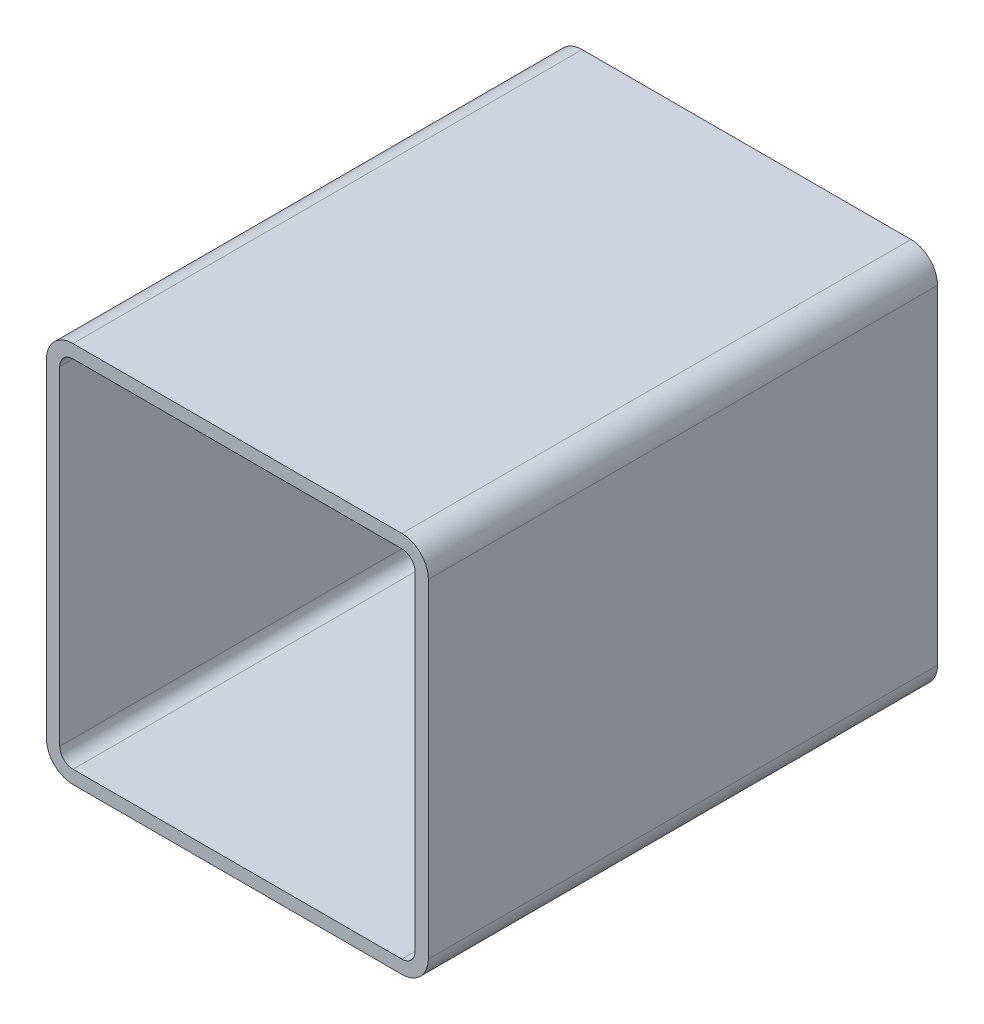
ISO-10303-21;
HEADER;
FILE_DESCRIPTION(('STEP AP214'),'2;1');
FILE_NAME('part.step','',(''),(''),'','','');
FILE_SCHEMA(('AUTOMOTIVE_DESIGN { 1 0 10303 214 1 1 1 1 }'));
ENDSEC;
DATA;
#1=APPLICATION_CONTEXT('core data for automotive mechanical design processes');
#2=APPLICATION_PROTOCOL_DEFINITION('international standard','automotive_design',2000,#1);
#3=PRODUCT_CONTEXT('',#1,'mechanical');
#4=PRODUCT('Part','Part','',(#3));
#5=PRODUCT_RELATED_PRODUCT_CATEGORY('part','',(#4));
#6=PRODUCT_DEFINITION_FORMATION('','',#4);
#7=PRODUCT_DEFINITION_CONTEXT('part definition',#1,'design');
#8=PRODUCT_DEFINITION('design','',#6,#7);
#9=PRODUCT_DEFINITION_SHAPE('','',#8);
#10=(LENGTH_UNIT() NAMED_UNIT(*) SI_UNIT(.MILLI.,.METRE.));
#11=(NAMED_UNIT(*) PLANE_ANGLE_UNIT() SI_UNIT($,.RADIAN.));
#12=(NAMED_UNIT(*) SI_UNIT($,.STERADIAN.) SOLID_ANGLE_UNIT());
#13=UNCERTAINTY_MEASURE_WITH_UNIT(LENGTH_MEASURE(1.E-05),#10,'distance_accuracy_value','');
#14=(GEOMETRIC_REPRESENTATION_CONTEXT(3) GLOBAL_UNCERTAINTY_ASSIGNED_CONTEXT((#13)) GLOBAL_UNIT_ASSIGNED_CONTEXT((#10,
#11,#12)) REPRESENTATION_CONTEXT('',''));
#15=CARTESIAN_POINT('',(0.,0.,0.));
#16=DIRECTION('',(0.,0.,1.));
#17=DIRECTION('',(1.,0.,0.));
#18=AXIS2_PLACEMENT_3D('',#15,#16,#17);
#19=CARTESIAN_POINT('',(16.4520021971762,214.668222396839,304.8));
#20=DIRECTION('',(0.,0.,1.));
#21=DIRECTION('',(1.,0.,0.));
#22=AXIS2_PLACEMENT_3D('',#19,#20,#21);
#23=PLANE('',#22);
#24=CARTESIAN_POINT('',(16.4520021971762,214.668222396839,304.8));
#25=DIRECTION('',(0.,0.,1.));
#26=DIRECTION('',(1.,0.,0.));
#27=AXIS2_PLACEMENT_3D('',#24,#25,#26);
#28=CIRCLE('',#27,15.875);
#29=CARTESIAN_POINT('',(16.4520021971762,230.543222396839,304.8));
#30=VERTEX_POINT('',#29);
#31=CARTESIAN_POINT('',(0.577002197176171,214.668222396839,304.8));
#32=VERTEX_POINT('',#31);
#33=EDGE_CURVE('E211',#30,#32,#28,.T.);
#34=ORIENTED_EDGE('',*,*,#33,.T.);
#35=DIRECTION('',(0.,-1.,0.));
#36=VECTOR('',#35,1.);
#37=CARTESIAN_POINT('',(0.577002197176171,17.8182223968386,304.8));
#38=LINE('',#37,#36);
#39=CARTESIAN_POINT('',(0.577002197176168,17.8182223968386,304.8));
#40=VERTEX_POINT('',#39);
#41=EDGE_CURVE('E214',#32,#40,#38,.T.);
#42=ORIENTED_EDGE('',*,*,#41,.T.);
#43=CARTESIAN_POINT('',(16.4520021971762,17.8182223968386,304.8));
#44=DIRECTION('',(0.,0.,1.));
#45=DIRECTION('',(1.,0.,0.));
#46=AXIS2_PLACEMENT_3D('',#43,#44,#45);
#47=CIRCLE('',#46,15.875);
#48=CARTESIAN_POINT('',(16.4520021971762,1.94322239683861,304.8));
#49=VERTEX_POINT('',#48);
#50=EDGE_CURVE('E217',#40,#49,#47,.T.);
#51=ORIENTED_EDGE('',*,*,#50,.T.);
#52=DIRECTION('',(1.,0.,0.));
#53=VECTOR('',#52,1.);
#54=CARTESIAN_POINT('',(213.302002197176,1.94322239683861,304.8));
#55=LINE('',#54,#53);
#56=CARTESIAN_POINT('',(213.302002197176,1.9432223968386,304.8));
#57=VERTEX_POINT('',#56);
#58=EDGE_CURVE('E219',#49,#57,#55,.T.);
#59=ORIENTED_EDGE('',*,*,#58,.T.);
#60=CARTESIAN_POINT('',(213.302002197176,17.8182223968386,304.8));
#61=DIRECTION('',(0.,0.,1.));
#62=DIRECTION('',(1.,0.,0.));
#63=AXIS2_PLACEMENT_3D('',#60,#61,#62);
#64=CIRCLE('',#63,15.875);
#65=CARTESIAN_POINT('',(229.177002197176,17.8182223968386,304.8));
#66=VERTEX_POINT('',#65);
#67=EDGE_CURVE('E221',#57,#66,#64,.T.);
#68=ORIENTED_EDGE('',*,*,#67,.T.);
#69=DIRECTION('',(0.,1.,0.));
#70=VECTOR('',#69,1.);
#71=CARTESIAN_POINT('',(229.177002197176,214.668222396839,304.8));
#72=LINE('',#71,#70);
#73=CARTESIAN_POINT('',(229.177002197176,214.668222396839,304.8));
#74=VERTEX_POINT('',#73);
#75=EDGE_CURVE('E223',#66,#74,#72,.T.);
#76=ORIENTED_EDGE('',*,*,#75,.T.);
#77=CARTESIAN_POINT('',(213.302002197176,214.668222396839,304.8));
#78=DIRECTION('',(0.,0.,1.));
#79=DIRECTION('',(1.,0.,0.));
#80=AXIS2_PLACEMENT_3D('',#77,#78,#79);
#81=CIRCLE('',#80,15.875);
#82=CARTESIAN_POINT('',(213.302002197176,230.543222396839,304.8));
#83=VERTEX_POINT('',#82);
#84=EDGE_CURVE('E225',#74,#83,#81,.T.);
#85=ORIENTED_EDGE('',*,*,#84,.T.);
#86=DIRECTION('',(-1.,0.,0.));
#87=VECTOR('',#86,1.);
#88=CARTESIAN_POINT('',(16.4520021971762,230.543222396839,304.8));
#89=LINE('',#88,#87);
#90=EDGE_CURVE('E227',#83,#30,#89,.T.);
#91=ORIENTED_EDGE('',*,*,#90,.T.);
#92=EDGE_LOOP('',(#34,#42,#51,#59,#68,#76,#85,#91));
#93=FACE_BOUND('',#92,.T.);
#94=DIRECTION('',(0.,-1.,0.));
#95=VECTOR('',#94,1.);
#96=CARTESIAN_POINT('',(8.51450219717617,17.8182223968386,304.8));
#97=LINE('',#96,#95);
#98=CARTESIAN_POINT('',(8.51450219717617,214.668222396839,304.8));
#99=VERTEX_POINT('',#98);
#100=CARTESIAN_POINT('',(8.51450219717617,17.8182223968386,304.8));
#101=VERTEX_POINT('',#100);
#102=EDGE_CURVE('E154',#99,#101,#97,.T.);
#103=ORIENTED_EDGE('',*,*,#102,.F.);
#104=CARTESIAN_POINT('',(16.4520021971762,214.668222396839,304.8));
#105=DIRECTION('',(0.,0.,1.));
#106=DIRECTION('',(1.,0.,0.));
#107=AXIS2_PLACEMENT_3D('',#104,#105,#106);
#108=CIRCLE('',#107,7.9375);
#109=CARTESIAN_POINT('',(16.4520021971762,222.605722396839,304.8));
#110=VERTEX_POINT('',#109);
#111=EDGE_CURVE('E146',#110,#99,#108,.T.);
#112=ORIENTED_EDGE('',*,*,#111,.F.);
#113=DIRECTION('',(-1.,0.,0.));
#114=VECTOR('',#113,1.);
#115=CARTESIAN_POINT('',(16.4520021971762,222.605722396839,304.8));
#116=LINE('',#115,#114);
#117=CARTESIAN_POINT('',(213.302002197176,222.605722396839,304.8));
#118=VERTEX_POINT('',#117);
#119=EDGE_CURVE('E179',#118,#110,#116,.T.);
#120=ORIENTED_EDGE('',*,*,#119,.F.);
#121=CARTESIAN_POINT('',(213.302002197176,214.668222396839,304.8));
#122=DIRECTION('',(0.,0.,1.));
#123=DIRECTION('',(1.,0.,0.));
#124=AXIS2_PLACEMENT_3D('',#121,#122,#123);
#125=CIRCLE('',#124,7.93750000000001);
#126=CARTESIAN_POINT('',(221.239502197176,214.668222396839,304.8));
#127=VERTEX_POINT('',#126);
#128=EDGE_CURVE('E177',#127,#118,#125,.T.);
#129=ORIENTED_EDGE('',*,*,#128,.F.);
#130=DIRECTION('',(0.,1.,0.));
#131=VECTOR('',#130,1.);
#132=CARTESIAN_POINT('',(221.239502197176,214.668222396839,304.8));
#133=LINE('',#132,#131);
#134=CARTESIAN_POINT('',(221.239502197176,17.8182223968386,304.8));
#135=VERTEX_POINT('',#134);
#136=EDGE_CURVE('E175',#135,#127,#133,.T.);
#137=ORIENTED_EDGE('',*,*,#136,.F.);
#138=CARTESIAN_POINT('',(213.302002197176,17.8182223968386,304.8));
#139=DIRECTION('',(0.,0.,1.));
#140=DIRECTION('',(1.,0.,0.));
#141=AXIS2_PLACEMENT_3D('',#138,#139,#140);
#142=CIRCLE('',#141,7.93750000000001);
#143=CARTESIAN_POINT('',(213.302002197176,9.88072239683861,304.8));
#144=VERTEX_POINT('',#143);
#145=EDGE_CURVE('E173',#144,#135,#142,.T.);
#146=ORIENTED_EDGE('',*,*,#145,.F.);
#147=DIRECTION('',(1.,0.,0.));
#148=VECTOR('',#147,1.);
#149=CARTESIAN_POINT('',(213.302002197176,9.88072239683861,304.8));
#150=LINE('',#149,#148);
#151=CARTESIAN_POINT('',(16.4520021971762,9.88072239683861,304.8));
#152=VERTEX_POINT('',#151);
#153=EDGE_CURVE('E169',#152,#144,#150,.T.);
#154=ORIENTED_EDGE('',*,*,#153,.F.);
#155=CARTESIAN_POINT('',(16.4520021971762,17.8182223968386,304.8));
#156=DIRECTION('',(0.,0.,1.));
#157=DIRECTION('',(1.,0.,0.));
#158=AXIS2_PLACEMENT_3D('',#155,#156,#157);
#159=CIRCLE('',#158,7.9375);
#160=EDGE_CURVE('E167',#101,#152,#159,.T.);
#161=ORIENTED_EDGE('',*,*,#160,.F.);
#162=EDGE_LOOP('',(#103,#112,#120,#129,#137,#146,#154,#161));
#163=FACE_BOUND('',#162,.T.);
#164=ADVANCED_FACE('F33',(#93,#163),#23,.T.);
#165=CARTESIAN_POINT('',(16.4520021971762,214.668222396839,0.));
#166=DIRECTION('',(0.,0.,1.));
#167=DIRECTION('',(1.,0.,0.));
#168=AXIS2_PLACEMENT_3D('',#165,#166,#167);
#169=PLANE('',#168);
#170=CARTESIAN_POINT('',(16.4520021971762,214.668222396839,0.));
#171=DIRECTION('',(0.,0.,1.));
#172=DIRECTION('',(1.,0.,0.));
#173=AXIS2_PLACEMENT_3D('',#170,#171,#172);
#174=CIRCLE('',#173,15.875);
#175=CARTESIAN_POINT('',(16.4520021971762,230.543222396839,0.));
#176=VERTEX_POINT('',#175);
#177=CARTESIAN_POINT('',(0.577002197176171,214.668222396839,0.));
#178=VERTEX_POINT('',#177);
#179=EDGE_CURVE('E162',#176,#178,#174,.T.);
#180=ORIENTED_EDGE('',*,*,#179,.F.);
#181=DIRECTION('',(-1.,0.,0.));
#182=VECTOR('',#181,1.);
#183=CARTESIAN_POINT('',(16.4520021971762,230.543222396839,0.));
#184=LINE('',#183,#182);
#185=CARTESIAN_POINT('',(213.302002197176,230.543222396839,0.));
#186=VERTEX_POINT('',#185);
#187=EDGE_CURVE('E215',#186,#176,#184,.T.);
#188=ORIENTED_EDGE('',*,*,#187,.F.);
#189=CARTESIAN_POINT('',(213.302002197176,214.668222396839,0.));
#190=DIRECTION('',(0.,0.,1.));
#191=DIRECTION('',(1.,0.,0.));
#192=AXIS2_PLACEMENT_3D('',#189,#190,#191);
#193=CIRCLE('',#192,15.875);
#194=CARTESIAN_POINT('',(229.177002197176,214.668222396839,0.));
#195=VERTEX_POINT('',#194);
#196=EDGE_CURVE('E242',#195,#186,#193,.T.);
#197=ORIENTED_EDGE('',*,*,#196,.F.);
#198=DIRECTION('',(0.,1.,0.));
#199=VECTOR('',#198,1.);
#200=CARTESIAN_POINT('',(229.177002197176,214.668222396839,0.));
#201=LINE('',#200,#199);
#202=CARTESIAN_POINT('',(229.177002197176,17.8182223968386,0.));
#203=VERTEX_POINT('',#202);
#204=EDGE_CURVE('E240',#203,#195,#201,.T.);
#205=ORIENTED_EDGE('',*,*,#204,.F.);
#206=CARTESIAN_POINT('',(213.302002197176,17.8182223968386,0.));
#207=DIRECTION('',(0.,0.,1.));
#208=DIRECTION('',(1.,0.,0.));
#209=AXIS2_PLACEMENT_3D('',#206,#207,#208);
#210=CIRCLE('',#209,15.875);
#211=CARTESIAN_POINT('',(213.302002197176,1.9432223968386,0.));
#212=VERTEX_POINT('',#211);
#213=EDGE_CURVE('E238',#212,#203,#210,.T.);
#214=ORIENTED_EDGE('',*,*,#213,.F.);
#215=DIRECTION('',(1.,0.,0.));
#216=VECTOR('',#215,1.);
#217=CARTESIAN_POINT('',(213.302002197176,1.94322239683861,0.));
#218=LINE('',#217,#216);
#219=CARTESIAN_POINT('',(16.4520021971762,1.94322239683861,0.));
#220=VERTEX_POINT('',#219);
#221=EDGE_CURVE('E236',#220,#212,#218,.T.);
#222=ORIENTED_EDGE('',*,*,#221,.F.);
#223=CARTESIAN_POINT('',(16.4520021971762,17.8182223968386,0.));
#224=DIRECTION('',(0.,0.,1.));
#225=DIRECTION('',(1.,0.,0.));
#226=AXIS2_PLACEMENT_3D('',#223,#224,#225);
#227=CIRCLE('',#226,15.875);
#228=CARTESIAN_POINT('',(0.577002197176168,17.8182223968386,0.));
#229=VERTEX_POINT('',#228);
#230=EDGE_CURVE('E234',#229,#220,#227,.T.);
#231=ORIENTED_EDGE('',*,*,#230,.F.);
#232=DIRECTION('',(0.,-1.,0.));
#233=VECTOR('',#232,1.);
#234=CARTESIAN_POINT('',(0.577002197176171,17.8182223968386,0.));
#235=LINE('',#234,#233);
#236=EDGE_CURVE('E232',#178,#229,#235,.T.);
#237=ORIENTED_EDGE('',*,*,#236,.F.);
#238=EDGE_LOOP('',(#180,#188,#197,#205,#214,#222,#231,#237));
#239=FACE_BOUND('',#238,.T.);
#240=CARTESIAN_POINT('',(16.4520021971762,214.668222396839,0.));
#241=DIRECTION('',(0.,0.,1.));
#242=DIRECTION('',(1.,0.,0.));
#243=AXIS2_PLACEMENT_3D('',#240,#241,#242);
#244=CIRCLE('',#243,7.9375);
#245=CARTESIAN_POINT('',(16.4520021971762,222.605722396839,0.));
#246=VERTEX_POINT('',#245);
#247=CARTESIAN_POINT('',(8.51450219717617,214.668222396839,0.));
#248=VERTEX_POINT('',#247);
#249=EDGE_CURVE('E56',#246,#248,#244,.T.);
#250=ORIENTED_EDGE('',*,*,#249,.T.);
#251=DIRECTION('',(0.,-1.,0.));
#252=VECTOR('',#251,1.);
#253=CARTESIAN_POINT('',(8.51450219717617,17.8182223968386,0.));
#254=LINE('',#253,#252);
#255=CARTESIAN_POINT('',(8.51450219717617,17.8182223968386,0.));
#256=VERTEX_POINT('',#255);
#257=EDGE_CURVE('E161',#248,#256,#254,.T.);
#258=ORIENTED_EDGE('',*,*,#257,.T.);
#259=CARTESIAN_POINT('',(16.4520021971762,17.8182223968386,0.));
#260=DIRECTION('',(0.,0.,1.));
#261=DIRECTION('',(1.,0.,0.));
#262=AXIS2_PLACEMENT_3D('',#259,#260,#261);
#263=CIRCLE('',#262,7.9375);
#264=CARTESIAN_POINT('',(16.4520021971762,9.88072239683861,0.));
#265=VERTEX_POINT('',#264);
#266=EDGE_CURVE('E183',#256,#265,#263,.T.);
#267=ORIENTED_EDGE('',*,*,#266,.T.);
#268=DIRECTION('',(1.,0.,0.));
#269=VECTOR('',#268,1.);
#270=CARTESIAN_POINT('',(213.302002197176,9.88072239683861,0.));
#271=LINE('',#270,#269);
#272=CARTESIAN_POINT('',(213.302002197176,9.88072239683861,0.));
#273=VERTEX_POINT('',#272);
#274=EDGE_CURVE('E186',#265,#273,#271,.T.);
#275=ORIENTED_EDGE('',*,*,#274,.T.);
#276=CARTESIAN_POINT('',(213.302002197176,17.8182223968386,0.));
#277=DIRECTION('',(0.,0.,1.));
#278=DIRECTION('',(1.,0.,0.));
#279=AXIS2_PLACEMENT_3D('',#276,#277,#278);
#280=CIRCLE('',#279,7.93750000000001);
#281=CARTESIAN_POINT('',(221.239502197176,17.8182223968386,0.));
#282=VERTEX_POINT('',#281);
#283=EDGE_CURVE('E189',#273,#282,#280,.T.);
#284=ORIENTED_EDGE('',*,*,#283,.T.);
#285=DIRECTION('',(0.,1.,0.));
#286=VECTOR('',#285,1.);
#287=CARTESIAN_POINT('',(221.239502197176,214.668222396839,0.));
#288=LINE('',#287,#286);
#289=CARTESIAN_POINT('',(221.239502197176,214.668222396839,0.));
#290=VERTEX_POINT('',#289);
#291=EDGE_CURVE('E192',#282,#290,#288,.T.);
#292=ORIENTED_EDGE('',*,*,#291,.T.);
#293=CARTESIAN_POINT('',(213.302002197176,214.668222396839,0.));
#294=DIRECTION('',(0.,0.,1.));
#295=DIRECTION('',(1.,0.,0.));
#296=AXIS2_PLACEMENT_3D('',#293,#294,#295);
#297=CIRCLE('',#296,7.93750000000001);
#298=CARTESIAN_POINT('',(213.302002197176,222.605722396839,0.));
#299=VERTEX_POINT('',#298);
#300=EDGE_CURVE('E195',#290,#299,#297,.T.);
#301=ORIENTED_EDGE('',*,*,#300,.T.);
#302=DIRECTION('',(-1.,0.,0.));
#303=VECTOR('',#302,1.);
#304=CARTESIAN_POINT('',(16.4520021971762,222.605722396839,0.));
#305=LINE('',#304,#303);
#306=EDGE_CURVE('E155',#299,#246,#305,.T.);
#307=ORIENTED_EDGE('',*,*,#306,.T.);
#308=EDGE_LOOP('',(#250,#258,#267,#275,#284,#292,#301,#307));
#309=FACE_BOUND('',#308,.T.);
#310=ADVANCED_FACE('F272',(#239,#309),#169,.F.);
#311=CARTESIAN_POINT('',(16.4520021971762,214.668222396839,304.8));
#312=DIRECTION('',(0.,0.,-1.));
#313=DIRECTION('',(-1.,0.,0.));
#314=AXIS2_PLACEMENT_3D('',#311,#312,#313);
#315=CYLINDRICAL_SURFACE('',#314,15.875);
#316=ORIENTED_EDGE('',*,*,#179,.T.);
#317=DIRECTION('',(0.,0.,-1.));
#318=VECTOR('',#317,1.);
#319=CARTESIAN_POINT('',(0.577002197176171,214.668222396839,304.8));
#320=LINE('',#319,#318);
#321=EDGE_CURVE('E11',#32,#178,#320,.T.);
#322=ORIENTED_EDGE('',*,*,#321,.F.);
#323=ORIENTED_EDGE('',*,*,#33,.F.);
#324=DIRECTION('',(0.,0.,-1.));
#325=VECTOR('',#324,1.);
#326=CARTESIAN_POINT('',(16.4520021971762,230.543222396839,304.8));
#327=LINE('',#326,#325);
#328=EDGE_CURVE('E229',#30,#176,#327,.T.);
#329=ORIENTED_EDGE('',*,*,#328,.T.);
#330=EDGE_LOOP('',(#316,#322,#323,#329));
#331=FACE_BOUND('',#330,.T.);
#332=ADVANCED_FACE('F35',(#331),#315,.T.);
#333=CARTESIAN_POINT('',(0.577002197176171,17.8182223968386,304.8));
#334=DIRECTION('',(1.,0.,0.));
#335=DIRECTION('',(0.,0.,-1.));
#336=AXIS2_PLACEMENT_3D('',#333,#334,#335);
#337=PLANE('',#336);
#338=ORIENTED_EDGE('',*,*,#236,.T.);
#339=DIRECTION('',(0.,0.,-1.));
#340=VECTOR('',#339,1.);
#341=CARTESIAN_POINT('',(0.577002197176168,17.8182223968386,304.8));
#342=LINE('',#341,#340);
#343=EDGE_CURVE('E41',#40,#229,#342,.T.);
#344=ORIENTED_EDGE('',*,*,#343,.F.);
#345=ORIENTED_EDGE('',*,*,#41,.F.);
#346=ORIENTED_EDGE('',*,*,#321,.T.);
#347=EDGE_LOOP('',(#338,#344,#345,#346));
#348=FACE_BOUND('',#347,.T.);
#349=ADVANCED_FACE('F289',(#348),#337,.F.);
#350=CARTESIAN_POINT('',(16.4520021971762,17.8182223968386,304.8));
#351=DIRECTION('',(0.,0.,-1.));
#352=DIRECTION('',(-1.,0.,0.));
#353=AXIS2_PLACEMENT_3D('',#350,#351,#352);
#354=CYLINDRICAL_SURFACE('',#353,15.875);
#355=ORIENTED_EDGE('',*,*,#230,.T.);
#356=DIRECTION('',(0.,0.,-1.));
#357=VECTOR('',#356,1.);
#358=CARTESIAN_POINT('',(16.4520021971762,1.94322239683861,304.8));
#359=LINE('',#358,#357);
#360=EDGE_CURVE('E259',#49,#220,#359,.T.);
#361=ORIENTED_EDGE('',*,*,#360,.F.);
#362=ORIENTED_EDGE('',*,*,#50,.F.);
#363=ORIENTED_EDGE('',*,*,#343,.T.);
#364=EDGE_LOOP('',(#355,#361,#362,#363));
#365=FACE_BOUND('',#364,.T.);
#366=ADVANCED_FACE('F266',(#365),#354,.T.);
#367=CARTESIAN_POINT('',(213.302002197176,1.94322239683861,304.8));
#368=DIRECTION('',(0.,1.,0.));
#369=DIRECTION('',(0.,0.,1.));
#370=AXIS2_PLACEMENT_3D('',#367,#368,#369);
#371=PLANE('',#370);
#372=ORIENTED_EDGE('',*,*,#221,.T.);
#373=DIRECTION('',(0.,0.,-1.));
#374=VECTOR('',#373,1.);
#375=CARTESIAN_POINT('',(213.302002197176,1.9432223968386,304.8));
#376=LINE('',#375,#374);
#377=EDGE_CURVE('E256',#57,#212,#376,.T.);
#378=ORIENTED_EDGE('',*,*,#377,.F.);
#379=ORIENTED_EDGE('',*,*,#58,.F.);
#380=ORIENTED_EDGE('',*,*,#360,.T.);
#381=EDGE_LOOP('',(#372,#378,#379,#380));
#382=FACE_BOUND('',#381,.T.);
#383=ADVANCED_FACE('F278',(#382),#371,.F.);
#384=CARTESIAN_POINT('',(213.302002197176,17.8182223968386,304.8));
#385=DIRECTION('',(0.,0.,-1.));
#386=DIRECTION('',(-1.,0.,0.));
#387=AXIS2_PLACEMENT_3D('',#384,#385,#386);
#388=CYLINDRICAL_SURFACE('',#387,15.875);
#389=ORIENTED_EDGE('',*,*,#213,.T.);
#390=DIRECTION('',(0.,0.,-1.));
#391=VECTOR('',#390,1.);
#392=CARTESIAN_POINT('',(229.177002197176,17.8182223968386,304.8));
#393=LINE('',#392,#391);
#394=EDGE_CURVE('E253',#66,#203,#393,.T.);
#395=ORIENTED_EDGE('',*,*,#394,.F.);
#396=ORIENTED_EDGE('',*,*,#67,.F.);
#397=ORIENTED_EDGE('',*,*,#377,.T.);
#398=EDGE_LOOP('',(#389,#395,#396,#397));
#399=FACE_BOUND('',#398,.T.);
#400=ADVANCED_FACE('F282',(#399),#388,.T.);
#401=CARTESIAN_POINT('',(229.177002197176,214.668222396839,304.8));
#402=DIRECTION('',(-1.,0.,0.));
#403=DIRECTION('',(0.,0.,1.));
#404=AXIS2_PLACEMENT_3D('',#401,#402,#403);
#405=PLANE('',#404);
#406=ORIENTED_EDGE('',*,*,#204,.T.);
#407=DIRECTION('',(0.,0.,-1.));
#408=VECTOR('',#407,1.);
#409=CARTESIAN_POINT('',(229.177002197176,214.668222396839,304.8));
#410=LINE('',#409,#408);
#411=EDGE_CURVE('E250',#74,#195,#410,.T.);
#412=ORIENTED_EDGE('',*,*,#411,.F.);
#413=ORIENTED_EDGE('',*,*,#75,.F.);
#414=ORIENTED_EDGE('',*,*,#394,.T.);
#415=EDGE_LOOP('',(#406,#412,#413,#414));
#416=FACE_BOUND('',#415,.T.);
#417=ADVANCED_FACE('F302',(#416),#405,.F.);
#418=CARTESIAN_POINT('',(213.302002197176,214.668222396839,304.8));
#419=DIRECTION('',(0.,0.,-1.));
#420=DIRECTION('',(-1.,0.,0.));
#421=AXIS2_PLACEMENT_3D('',#418,#419,#420);
#422=CYLINDRICAL_SURFACE('',#421,15.875);
#423=ORIENTED_EDGE('',*,*,#196,.T.);
#424=DIRECTION('',(0.,0.,-1.));
#425=VECTOR('',#424,1.);
#426=CARTESIAN_POINT('',(213.302002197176,230.543222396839,304.8));
#427=LINE('',#426,#425);
#428=EDGE_CURVE('E247',#83,#186,#427,.T.);
#429=ORIENTED_EDGE('',*,*,#428,.F.);
#430=ORIENTED_EDGE('',*,*,#84,.F.);
#431=ORIENTED_EDGE('',*,*,#411,.T.);
#432=EDGE_LOOP('',(#423,#429,#430,#431));
#433=FACE_BOUND('',#432,.T.);
#434=ADVANCED_FACE('F300',(#433),#422,.T.);
#435=CARTESIAN_POINT('',(16.4520021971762,230.543222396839,304.8));
#436=DIRECTION('',(0.,-1.,0.));
#437=DIRECTION('',(0.,0.,-1.));
#438=AXIS2_PLACEMENT_3D('',#435,#436,#437);
#439=PLANE('',#438);
#440=ORIENTED_EDGE('',*,*,#187,.T.);
#441=ORIENTED_EDGE('',*,*,#328,.F.);
#442=ORIENTED_EDGE('',*,*,#90,.F.);
#443=ORIENTED_EDGE('',*,*,#428,.T.);
#444=EDGE_LOOP('',(#440,#441,#442,#443));
#445=FACE_BOUND('',#444,.T.);
#446=ADVANCED_FACE('F295',(#445),#439,.F.);
#447=CARTESIAN_POINT('',(16.4520021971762,214.668222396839,304.8));
#448=DIRECTION('',(0.,0.,-1.));
#449=DIRECTION('',(-1.,0.,0.));
#450=AXIS2_PLACEMENT_3D('',#447,#448,#449);
#451=CYLINDRICAL_SURFACE('',#450,7.9375);
#452=ORIENTED_EDGE('',*,*,#249,.F.);
#453=DIRECTION('',(0.,0.,-1.));
#454=VECTOR('',#453,1.);
#455=CARTESIAN_POINT('',(16.4520021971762,222.605722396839,304.8));
#456=LINE('',#455,#454);
#457=EDGE_CURVE('E150',#110,#246,#456,.T.);
#458=ORIENTED_EDGE('',*,*,#457,.F.);
#459=ORIENTED_EDGE('',*,*,#111,.T.);
#460=DIRECTION('',(0.,0.,-1.));
#461=VECTOR('',#460,1.);
#462=CARTESIAN_POINT('',(8.51450219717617,214.668222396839,304.8));
#463=LINE('',#462,#461);
#464=EDGE_CURVE('E149',#99,#248,#463,.T.);
#465=ORIENTED_EDGE('',*,*,#464,.T.);
#466=EDGE_LOOP('',(#452,#458,#459,#465));
#467=FACE_BOUND('',#466,.T.);
#468=ADVANCED_FACE('F148',(#467),#451,.F.);
#469=CARTESIAN_POINT('',(8.51450219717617,17.8182223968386,304.8));
#470=DIRECTION('',(1.,0.,0.));
#471=DIRECTION('',(0.,0.,-1.));
#472=AXIS2_PLACEMENT_3D('',#469,#470,#471);
#473=PLANE('',#472);
#474=ORIENTED_EDGE('',*,*,#257,.F.);
#475=ORIENTED_EDGE('',*,*,#464,.F.);
#476=ORIENTED_EDGE('',*,*,#102,.T.);
#477=DIRECTION('',(0.,0.,-1.));
#478=VECTOR('',#477,1.);
#479=CARTESIAN_POINT('',(8.51450219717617,17.8182223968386,304.8));
#480=LINE('',#479,#478);
#481=EDGE_CURVE('E163',#101,#256,#480,.T.);
#482=ORIENTED_EDGE('',*,*,#481,.T.);
#483=EDGE_LOOP('',(#474,#475,#476,#482));
#484=FACE_BOUND('',#483,.T.);
#485=ADVANCED_FACE('F158',(#484),#473,.T.);
#486=CARTESIAN_POINT('',(16.4520021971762,17.8182223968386,304.8));
#487=DIRECTION('',(0.,0.,-1.));
#488=DIRECTION('',(-1.,0.,0.));
#489=AXIS2_PLACEMENT_3D('',#486,#487,#488);
#490=CYLINDRICAL_SURFACE('',#489,7.9375);
#491=ORIENTED_EDGE('',*,*,#266,.F.);
#492=ORIENTED_EDGE('',*,*,#481,.F.);
#493=ORIENTED_EDGE('',*,*,#160,.T.);
#494=DIRECTION('',(0.,0.,-1.));
#495=VECTOR('',#494,1.);
#496=CARTESIAN_POINT('',(16.4520021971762,9.88072239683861,304.8));
#497=LINE('',#496,#495);
#498=EDGE_CURVE('E208',#152,#265,#497,.T.);
#499=ORIENTED_EDGE('',*,*,#498,.T.);
#500=EDGE_LOOP('',(#491,#492,#493,#499));
#501=FACE_BOUND('',#500,.T.);
#502=ADVANCED_FACE('F327',(#501),#490,.F.);
#503=CARTESIAN_POINT('',(213.302002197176,9.88072239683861,304.8));
#504=DIRECTION('',(0.,1.,0.));
#505=DIRECTION('',(0.,0.,1.));
#506=AXIS2_PLACEMENT_3D('',#503,#504,#505);
#507=PLANE('',#506);
#508=ORIENTED_EDGE('',*,*,#274,.F.);
#509=ORIENTED_EDGE('',*,*,#498,.F.);
#510=ORIENTED_EDGE('',*,*,#153,.T.);
#511=DIRECTION('',(0.,0.,-1.));
#512=VECTOR('',#511,1.);
#513=CARTESIAN_POINT('',(213.302002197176,9.88072239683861,304.8));
#514=LINE('',#513,#512);
#515=EDGE_CURVE('E206',#144,#273,#514,.T.);
#516=ORIENTED_EDGE('',*,*,#515,.T.);
#517=EDGE_LOOP('',(#508,#509,#510,#516));
#518=FACE_BOUND('',#517,.T.);
#519=ADVANCED_FACE('F331',(#518),#507,.T.);
#520=CARTESIAN_POINT('',(213.302002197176,17.8182223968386,304.8));
#521=DIRECTION('',(0.,0.,-1.));
#522=DIRECTION('',(-1.,0.,0.));
#523=AXIS2_PLACEMENT_3D('',#520,#521,#522);
#524=CYLINDRICAL_SURFACE('',#523,7.93750000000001);
#525=ORIENTED_EDGE('',*,*,#283,.F.);
#526=ORIENTED_EDGE('',*,*,#515,.F.);
#527=ORIENTED_EDGE('',*,*,#145,.T.);
#528=DIRECTION('',(0.,0.,-1.));
#529=VECTOR('',#528,1.);
#530=CARTESIAN_POINT('',(221.239502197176,17.8182223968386,304.8));
#531=LINE('',#530,#529);
#532=EDGE_CURVE('E204',#135,#282,#531,.T.);
#533=ORIENTED_EDGE('',*,*,#532,.T.);
#534=EDGE_LOOP('',(#525,#526,#527,#533));
#535=FACE_BOUND('',#534,.T.);
#536=ADVANCED_FACE('F337',(#535),#524,.F.);
#537=CARTESIAN_POINT('',(221.239502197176,214.668222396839,304.8));
#538=DIRECTION('',(-1.,0.,0.));
#539=DIRECTION('',(0.,0.,1.));
#540=AXIS2_PLACEMENT_3D('',#537,#538,#539);
#541=PLANE('',#540);
#542=ORIENTED_EDGE('',*,*,#291,.F.);
#543=ORIENTED_EDGE('',*,*,#532,.F.);
#544=ORIENTED_EDGE('',*,*,#136,.T.);
#545=DIRECTION('',(0.,0.,-1.));
#546=VECTOR('',#545,1.);
#547=CARTESIAN_POINT('',(221.239502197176,214.668222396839,304.8));
#548=LINE('',#547,#546);
#549=EDGE_CURVE('E202',#127,#290,#548,.T.);
#550=ORIENTED_EDGE('',*,*,#549,.T.);
#551=EDGE_LOOP('',(#542,#543,#544,#550));
#552=FACE_BOUND('',#551,.T.);
#553=ADVANCED_FACE('F341',(#552),#541,.T.);
#554=CARTESIAN_POINT('',(213.302002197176,214.668222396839,304.8));
#555=DIRECTION('',(0.,0.,-1.));
#556=DIRECTION('',(-1.,0.,0.));
#557=AXIS2_PLACEMENT_3D('',#554,#555,#556);
#558=CYLINDRICAL_SURFACE('',#557,7.93750000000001);
#559=ORIENTED_EDGE('',*,*,#300,.F.);
#560=ORIENTED_EDGE('',*,*,#549,.F.);
#561=ORIENTED_EDGE('',*,*,#128,.T.);
#562=DIRECTION('',(0.,0.,-1.));
#563=VECTOR('',#562,1.);
#564=CARTESIAN_POINT('',(213.302002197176,222.605722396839,304.8));
#565=LINE('',#564,#563);
#566=EDGE_CURVE('E48',#118,#299,#565,.T.);
#567=ORIENTED_EDGE('',*,*,#566,.T.);
#568=EDGE_LOOP('',(#559,#560,#561,#567));
#569=FACE_BOUND('',#568,.T.);
#570=ADVANCED_FACE('F345',(#569),#558,.F.);
#571=CARTESIAN_POINT('',(16.4520021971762,222.605722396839,304.8));
#572=DIRECTION('',(0.,-1.,0.));
#573=DIRECTION('',(0.,0.,-1.));
#574=AXIS2_PLACEMENT_3D('',#571,#572,#573);
#575=PLANE('',#574);
#576=ORIENTED_EDGE('',*,*,#306,.F.);
#577=ORIENTED_EDGE('',*,*,#566,.F.);
#578=ORIENTED_EDGE('',*,*,#119,.T.);
#579=ORIENTED_EDGE('',*,*,#457,.T.);
#580=EDGE_LOOP('',(#576,#577,#578,#579));
#581=FACE_BOUND('',#580,.T.);
#582=ADVANCED_FACE('F349',(#581),#575,.T.);
#583=CLOSED_SHELL('',(#164,#310,#332,#349,#366,#383,#400,#417,#434,#446,#468,#485,#502,#519,
#536,#553,#570,#582));
#584=MANIFOLD_SOLID_BREP('B2',#583);
#585=ADVANCED_BREP_SHAPE_REPRESENTATION('',(#18,#584),#14);
#586=SHAPE_DEFINITION_REPRESENTATION(#9,#585);
ENDSEC;
END-ISO-10303-21;
